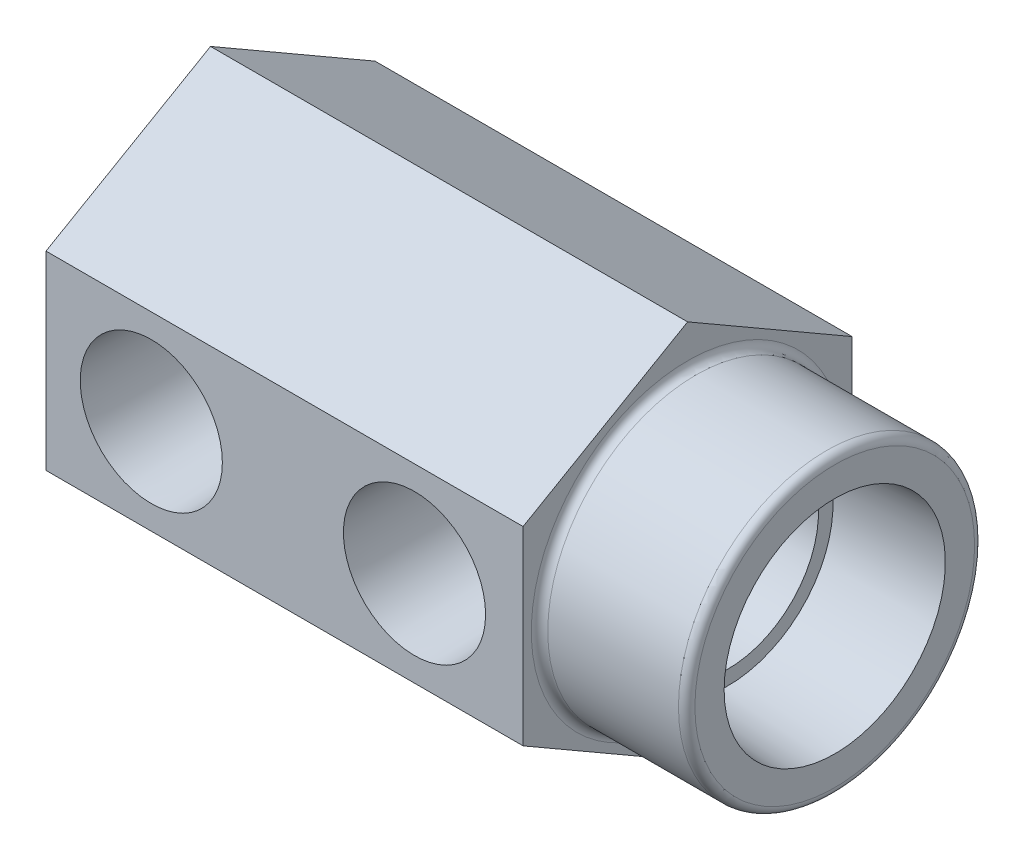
from build123d import *

# Parameters (mm, degrees)
BOSS_EXTRUDE1_DEPTH                  = 46.0375
SKETCH3_R                            = 14.2875
BOSS_EXTRUDE2_DEPTH                  = 14.1986
F_1_4_NPT_TAPPED_HOLE2_AT_2_COUNT    = 2
F_1_4_NPT_TAPPED_HOLE2_AT_2_PITCH    = 25.4
FILLET1_R                            = 0.79375
F_25_64_0_39063_DIAMETER_HOLE1_D     = 9.922002
F_25_64_0_39063_DIAMETER_HOLE1_DEPTH = 50.8
F_25_64_0_39063_DIAMETER_HOLE1_TIP   = 2.980870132
F_7_16_0_4375_DIAMETER_HOLE1_D       = 11.1125
F_7_16_0_4375_DIAMETER_HOLE1_DEPTH   = 42.9133
F_7_16_0_4375_DIAMETER_HOLE1_TIP     = 3.338531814


with BuildPart() as part:
    # Sketch2 → Boss-Extrude1 (new body)
    with BuildSketch(Plane(origin=(0, 0, 0), x_dir=(0, 0, -1), z_dir=(1, 0, 0))):
        Polygon((15.875, -9.165435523), (15.875, 9.165435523), (0, 18.330871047), (-15.875, 9.165435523), (-15.875, -9.165435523), (0, -18.330871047), align=None)
    extrude(amount=BOSS_EXTRUDE1_DEPTH)

    # Sketch3 → Boss-Extrude2 (add)
    with BuildSketch(Plane(origin=(46.0375, 0, 0), x_dir=(0, 0, -1), z_dir=(1, 0, 0))):
        with Locations(Location((0, 0, 0), (0, 0, 180))):
            Circle(SKETCH3_R)
    extrude(amount=BOSS_EXTRUDE2_DEPTH)

    # Sketch5 → Cut-Revolve1 (revolve, cut)
    with BuildSketch(Plane(origin=(0, 0, 0), x_dir=(1, 0, 0), z_dir=(0, 1, 0)), mode=Mode.PRIVATE) as cut_revolve1_sk:
        Polygon((49.9364, 8.73125), (36.1061, 8.73125), (36.1061, 0), (60.2361, 0), (60.2361, 10.674384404), (49.9364, 10.1346), align=None)
    revolve(cut_revolve1_sk.sketch.rotate(Axis((-14.001925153, 0, 0), (1, 0, 0)), 180), axis=Axis((-14.001925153, 0, 0), (1, 0, 0)), mode=Mode.SUBTRACT)

    # Sketch6 → 1_4 NPT Tapped Hole1 (revolve, cut)
    with BuildSketch(Plane(origin=(10.16, 0, -15.875), x_dir=(0, 1, 0), z_dir=(1, 0, 0))):
        Polygon((0, 0), (0, 20.411147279), (5.5626, 17.0688), (5.5626, 10.0203), (6.557978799, 10.0203), (6.858, 0), align=None)
    revolve(axis=Axis((10.16, 0, -22.225), (0, 0, 1)), mode=Mode.SUBTRACT)

    # Sketch8 → 1_4 NPT Tapped Hole2 (revolve, cut)
    with BuildSketch(Plane(origin=(10.16, 0, 15.875), x_dir=(0, -1, 0), z_dir=(1, 0, 0))):
        Polygon((0, 0), (0, 16.042347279), (5.5626, 12.7), (5.5626, 10.0203), (6.557978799, 10.0203), (6.858, 0), align=None)
    f_1_4_npt_tapped_hole2 = revolve(axis=Axis((10.16, 0, 22.225), (0, 0, -1)), mode=Mode.SUBTRACT)

    # 1_4 NPT Tapped Hole2 at 2: 1_4 NPT Tapped Hole2 ×2
    with Locations(*[(i * F_1_4_NPT_TAPPED_HOLE2_AT_2_PITCH, 0, 0) for i in range(1, F_1_4_NPT_TAPPED_HOLE2_AT_2_COUNT)]):
        add(f_1_4_npt_tapped_hole2, mode=Mode.SUBTRACT)

    # Fillet1
    fillet1_edges = [part.edges().sort_by_distance(p)[0] for p in [
        (46.0375, 0, -14.2875),
        (60.2361, 0, -14.2875),
    ]]
    fillet(fillet1_edges, radius=FILLET1_R)

    # 25_64 _0.39063_ Diameter Hole1
    with Locations(Plane(origin=(60.2361, 0, 0), x_dir=(0, 0, -1), z_dir=(1, 0, 0))):
        with Locations((0, 0)):
            Hole(F_25_64_0_39063_DIAMETER_HOLE1_D / 2, depth=F_25_64_0_39063_DIAMETER_HOLE1_DEPTH)
            with Locations((0, 0, -(F_25_64_0_39063_DIAMETER_HOLE1_DEPTH + F_25_64_0_39063_DIAMETER_HOLE1_TIP / 2))):  # 118° drill point
                Cone(0, F_25_64_0_39063_DIAMETER_HOLE1_D / 2, F_25_64_0_39063_DIAMETER_HOLE1_TIP, mode=Mode.SUBTRACT)

    # 7_16 _0.4375_ Diameter Hole1
    with Locations(Plane(origin=(60.2361, 0, 0), x_dir=(0, 0, -1), z_dir=(1, 0, 0))):
        with Locations((0, 0)):
            Hole(F_7_16_0_4375_DIAMETER_HOLE1_D / 2, depth=F_7_16_0_4375_DIAMETER_HOLE1_DEPTH)
            with Locations((0, 0, -(F_7_16_0_4375_DIAMETER_HOLE1_DEPTH + F_7_16_0_4375_DIAMETER_HOLE1_TIP / 2))):  # 118° drill point
                Cone(0, F_7_16_0_4375_DIAMETER_HOLE1_D / 2, F_7_16_0_4375_DIAMETER_HOLE1_TIP, mode=Mode.SUBTRACT)


solid = part.part
